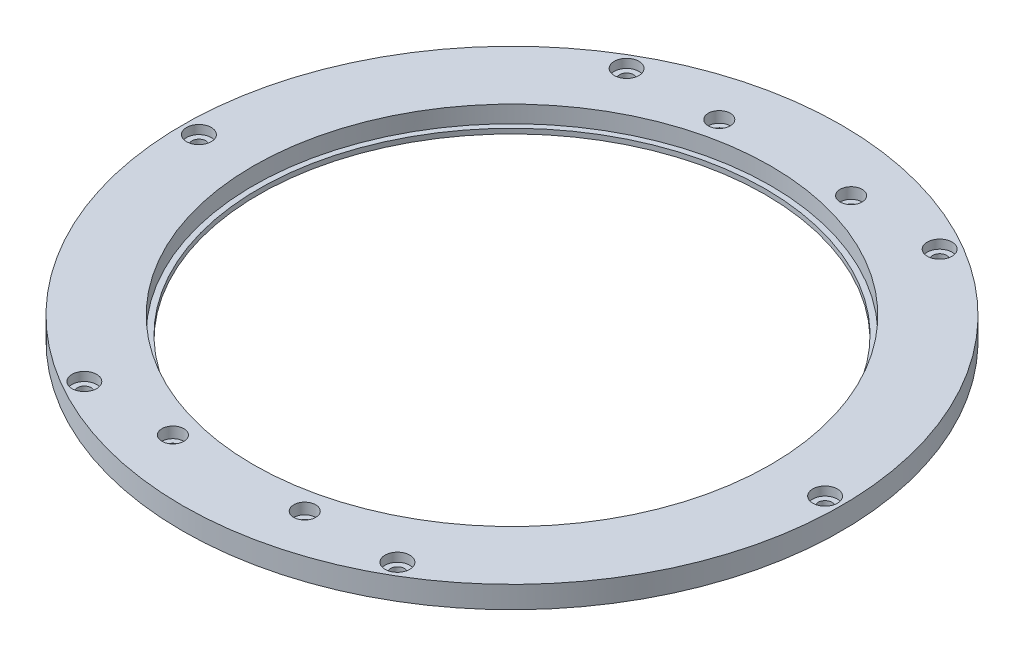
from build123d import *

# Parameters (mm, degrees)
SKETCH_1_R          = 60
SKETCH_1_R_2        = 47.1
EXTRUDE_1_DEPTH     = 4
SKETCH_2_R          = 47.1
SKETCH_2_R_2        = 46.1
EXTRUDE_2_DEPTH     = 0.9
SKETCH_3_R          = 1.25
CUT_EXTRUDE_1_DEPTH = 85.947042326
SKETCH_4_R          = 2.25
CUT_EXTRUDE_2_DEPTH = 1.6
SKETCH_5_R          = 1
CUT_EXTRUDE_3_DEPTH = 85.947042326
SKETCH_6_R          = 2
CUT_EXTRUDE_4_DEPTH = 2


with BuildPart() as part:
    # Sketch 1 → Extrude 1 (new body)
    with BuildSketch(Plane(origin=(0, 0, 0), x_dir=(1, 0, 0), z_dir=(0, 1, 0))):
        with Locations(Location((0, 0, 0), (0, 0, 270))):
            Circle(SKETCH_1_R)
        with Locations(Location((0, 0, 0), (0, 0, 270))):
            Circle(SKETCH_1_R_2, mode=Mode.SUBTRACT)
    extrude(amount=EXTRUDE_1_DEPTH)

    # Sketch 2 → Extrude 2 (add)
    with BuildSketch(Plane.XZ):
        with Locations(Location((0, 0, 0), (0, 0, 270))):
            Circle(SKETCH_2_R)
        with Locations(Location((0, 0, 0), (0, 0, 270))):
            Circle(SKETCH_2_R_2, mode=Mode.SUBTRACT)
    extrude(amount=-EXTRUDE_2_DEPTH)

    # Sketch 3 → Cut-Extrude 1 (cut, through all)
    with BuildSketch(Plane.XZ):
        with Locations(Location((-28.5, 49.363448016, 0), (0, 0, 270))):
            Circle(SKETCH_3_R)
        with Locations(Location((-57, 0, 0), (0, 0, 270))):
            Circle(SKETCH_3_R)
        with Locations(Location((-28.5, -49.363448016, 0), (0, 0, 270))):
            Circle(SKETCH_3_R)
        with Locations(Location((28.5, -49.363448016, 0), (0, 0, 270))):
            Circle(SKETCH_3_R)
        with Locations(Location((57, 0, 0), (0, 0, 270))):
            Circle(SKETCH_3_R)
        with Locations(Location((28.5, 49.363448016, 0), (0, 0, 270))):
            Circle(SKETCH_3_R)
    extrude(amount=-CUT_EXTRUDE_1_DEPTH, mode=Mode.SUBTRACT)

    # Sketch 4 → Cut-Extrude 2 (cut)
    with BuildSketch(Plane(origin=(0, 4, 0), x_dir=(1, 0, 0), z_dir=(0, 1, 0))):
        with Locations(Location((-28.5, 49.363448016, 0), (0, 0, 270))):
            Circle(SKETCH_4_R)
        with Locations(Location((28.5, 49.363448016, 0), (0, 0, 270))):
            Circle(SKETCH_4_R)
        with Locations(Location((57, 0, 0), (0, 0, 270))):
            Circle(SKETCH_4_R)
        with Locations(Location((28.5, -49.363448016, 0), (0, 0, 270))):
            Circle(SKETCH_4_R)
        with Locations(Location((-28.5, -49.363448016, 0), (0, 0, 270))):
            Circle(SKETCH_4_R)
        with Locations(Location((-57, 0, 0), (0, 0, 270))):
            Circle(SKETCH_4_R)
    extrude(amount=-CUT_EXTRUDE_2_DEPTH, mode=Mode.SUBTRACT)

    # Sketch 5 → Cut-Extrude 3 (cut, through all)
    with BuildSketch(Plane.XZ):
        with Locations(Location((-12, -49.73593463, 0), (0, 0, 270))):
            Circle(SKETCH_5_R)
        with Locations(Location((12, -49.73593463, 0), (0, 0, 270))):
            Circle(SKETCH_5_R)
        with Locations(Location((-12, 49.73593463, 0), (0, 0, 270))):
            Circle(SKETCH_5_R)
        with Locations(Location((12, 49.73593463, 0), (0, 0, 270))):
            Circle(SKETCH_5_R)
    extrude(amount=-CUT_EXTRUDE_3_DEPTH, mode=Mode.SUBTRACT)

    # Sketch 6 → Cut-Extrude 4 (cut)
    with BuildSketch(Plane(origin=(0, 4, 0), x_dir=(1, 0, 0), z_dir=(0, 1, 0))):
        with Locations(Location((-12, 49.73593463, 0), (0, 0, 270))):
            Circle(SKETCH_6_R)
        with Locations(Location((12, 49.73593463, 0), (0, 0, 270))):
            Circle(SKETCH_6_R)
        with Locations(Location((-12, -49.73593463, 0), (0, 0, 270))):
            Circle(SKETCH_6_R)
        with Locations(Location((12, -49.73593463, 0), (0, 0, 270))):
            Circle(SKETCH_6_R)
    extrude(amount=-CUT_EXTRUDE_4_DEPTH, mode=Mode.SUBTRACT)


solid = part.part
